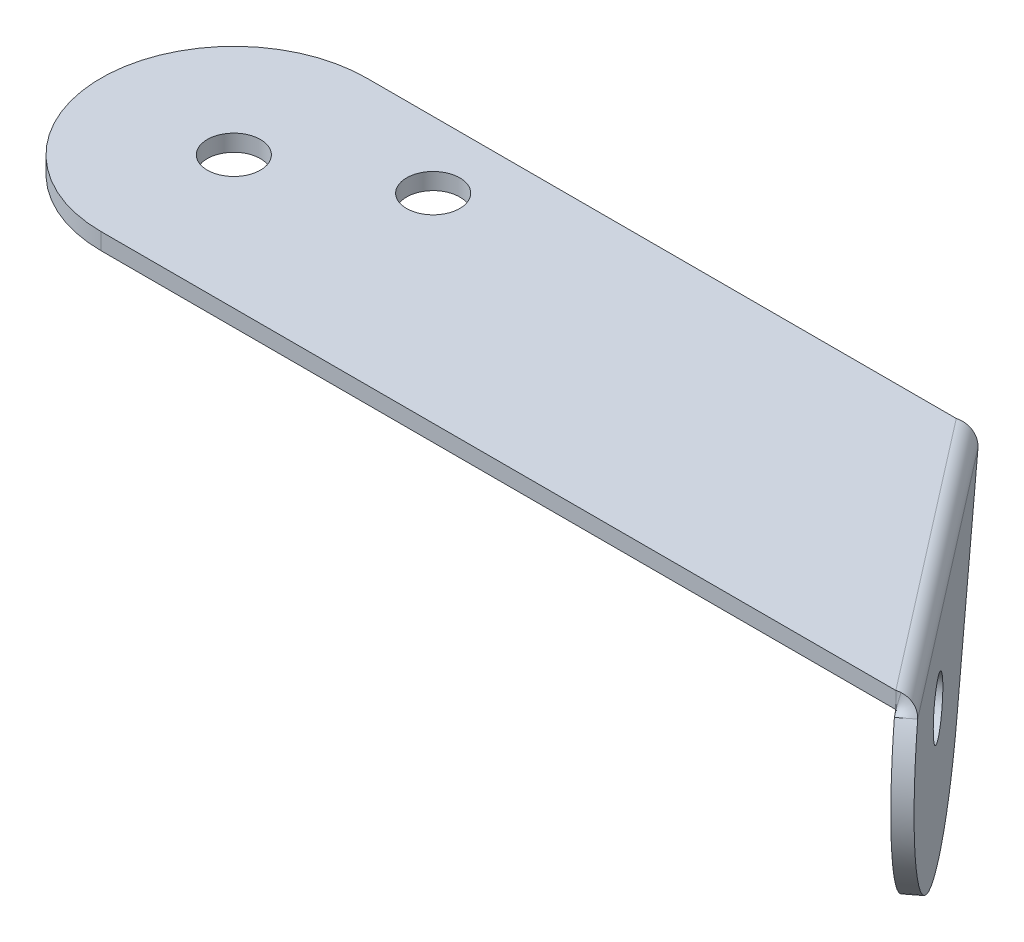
ISO-10303-21;
HEADER;
FILE_DESCRIPTION(('STEP AP214'),'2;1');
FILE_NAME('part.step','',(''),(''),'','','');
FILE_SCHEMA(('AUTOMOTIVE_DESIGN { 1 0 10303 214 1 1 1 1 }'));
ENDSEC;
DATA;
#1=APPLICATION_CONTEXT('core data for automotive mechanical design processes');
#2=APPLICATION_PROTOCOL_DEFINITION('international standard','automotive_design',2000,#1);
#3=PRODUCT_CONTEXT('',#1,'mechanical');
#4=PRODUCT('Part','Part','',(#3));
#5=PRODUCT_RELATED_PRODUCT_CATEGORY('part','',(#4));
#6=PRODUCT_DEFINITION_FORMATION('','',#4);
#7=PRODUCT_DEFINITION_CONTEXT('part definition',#1,'design');
#8=PRODUCT_DEFINITION('design','',#6,#7);
#9=PRODUCT_DEFINITION_SHAPE('','',#8);
#10=(LENGTH_UNIT() NAMED_UNIT(*) SI_UNIT(.MILLI.,.METRE.));
#11=(NAMED_UNIT(*) PLANE_ANGLE_UNIT() SI_UNIT($,.RADIAN.));
#12=(NAMED_UNIT(*) SI_UNIT($,.STERADIAN.) SOLID_ANGLE_UNIT());
#13=UNCERTAINTY_MEASURE_WITH_UNIT(LENGTH_MEASURE(1.E-05),#10,'distance_accuracy_value','');
#14=(GEOMETRIC_REPRESENTATION_CONTEXT(3) GLOBAL_UNCERTAINTY_ASSIGNED_CONTEXT((#13)) GLOBAL_UNIT_ASSIGNED_CONTEXT((#10,
#11,#12)) REPRESENTATION_CONTEXT('',''));
#15=CARTESIAN_POINT('',(0.,0.,0.));
#16=DIRECTION('',(0.,0.,1.));
#17=DIRECTION('',(1.,0.,0.));
#18=AXIS2_PLACEMENT_3D('',#15,#16,#17);
#19=CARTESIAN_POINT('',(44.8366612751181,-4.21600360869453,2.44339402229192));
#20=DIRECTION('',(0.791406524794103,0.,-0.611290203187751));
#21=DIRECTION('',(0.4837790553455,0.611290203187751,0.626324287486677));
#22=AXIS2_PLACEMENT_3D('',#19,#20,#21);
#23=PLANE('',#22);
#24=CARTESIAN_POINT('',(44.8366612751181,-4.21600360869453,2.44339402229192));
#25=DIRECTION('',(0.791406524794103,0.,-0.611290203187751));
#26=DIRECTION('',(0.4837790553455,0.611290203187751,0.626324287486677));
#27=AXIS2_PLACEMENT_3D('',#24,#25,#26);
#28=CIRCLE('',#27,1.60000000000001);
#29=CARTESIAN_POINT('',(45.6107077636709,-3.23793928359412,3.4455128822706));
#30=VERTEX_POINT('',#29);
#31=EDGE_CURVE('E230',#30,#30,#28,.T.);
#32=ORIENTED_EDGE('',*,*,#31,.F.);
#33=EDGE_LOOP('',(#32));
#34=FACE_BOUND('',#33,.T.);
#35=DIRECTION('',(-0.373675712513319,0.791406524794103,-0.4837790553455));
#36=VECTOR('',#35,1.);
#37=CARTESIAN_POINT('',(40.9664288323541,-9.10632523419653,-2.5672002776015));
#38=LINE('',#37,#36);
#39=CARTESIAN_POINT('',(40.9664288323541,-9.10632523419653,-2.5672002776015));
#40=VERTEX_POINT('',#39);
#41=CARTESIAN_POINT('',(36.6714480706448,-0.00999999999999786,-8.12769479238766));
#42=VERTEX_POINT('',#41);
#43=EDGE_CURVE('E238',#40,#42,#38,.T.);
#44=ORIENTED_EDGE('',*,*,#43,.T.);
#45=DIRECTION('',(0.611290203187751,0.,0.791406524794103));
#46=VECTOR('',#45,1.);
#47=CARTESIAN_POINT('',(44.8366612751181,-0.01000000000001,2.44339402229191));
#48=LINE('',#47,#46);
#49=CARTESIAN_POINT('',(48.9965588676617,-0.01000000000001,7.82900314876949));
#50=VERTEX_POINT('',#49);
#51=EDGE_CURVE('E237',#42,#50,#48,.T.);
#52=ORIENTED_EDGE('',*,*,#51,.T.);
#53=CARTESIAN_POINT('',(44.8366612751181,-4.21600360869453,2.44339402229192));
#54=DIRECTION('',(0.791406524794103,0.,-0.611290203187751));
#55=DIRECTION('',(0.4837790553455,0.611290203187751,0.626324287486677));
#56=AXIS2_PLACEMENT_3D('',#53,#54,#55);
#57=CIRCLE('',#56,8.);
#58=EDGE_CURVE('E82',#50,#40,#57,.T.);
#59=ORIENTED_EDGE('',*,*,#58,.T.);
#60=EDGE_LOOP('',(#44,#52,#59));
#61=FACE_BOUND('',#60,.T.);
#62=ADVANCED_FACE('F56',(#34,#61),#23,.T.);
#63=CARTESIAN_POINT('',(44.045254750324,-4.21600360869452,3.05468422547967));
#64=DIRECTION('',(0.791406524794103,0.,-0.611290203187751));
#65=DIRECTION('',(0.4837790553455,0.611290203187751,0.626324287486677));
#66=AXIS2_PLACEMENT_3D('',#63,#64,#65);
#67=PLANE('',#66);
#68=DIRECTION('',(0.611290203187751,0.,0.791406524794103));
#69=VECTOR('',#68,1.);
#70=CARTESIAN_POINT('',(44.045254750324,-0.0100000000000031,3.05468422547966));
#71=LINE('',#70,#69);
#72=CARTESIAN_POINT('',(35.8800415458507,-0.01,-7.51640458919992));
#73=VERTEX_POINT('',#72);
#74=CARTESIAN_POINT('',(48.2051523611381,-0.0100000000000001,8.44029333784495));
#75=VERTEX_POINT('',#74);
#76=EDGE_CURVE('E67',#73,#75,#71,.T.);
#77=ORIENTED_EDGE('',*,*,#76,.F.);
#78=DIRECTION('',(-0.373675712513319,0.791406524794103,-0.4837790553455));
#79=VECTOR('',#78,1.);
#80=CARTESIAN_POINT('',(40.17502230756,-9.10632523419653,-1.95591007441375));
#81=LINE('',#80,#79);
#82=CARTESIAN_POINT('',(40.17502230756,-9.10632523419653,-1.95591007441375));
#83=VERTEX_POINT('',#82);
#84=EDGE_CURVE('E244',#83,#73,#81,.T.);
#85=ORIENTED_EDGE('',*,*,#84,.F.);
#86=CARTESIAN_POINT('',(44.045254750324,-4.21600360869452,3.05468422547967));
#87=DIRECTION('',(0.791406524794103,0.,-0.611290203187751));
#88=DIRECTION('',(0.4837790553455,0.611290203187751,0.626324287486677));
#89=AXIS2_PLACEMENT_3D('',#86,#87,#88);
#90=CIRCLE('',#89,8.);
#91=EDGE_CURVE('E233',#75,#83,#90,.T.);
#92=ORIENTED_EDGE('',*,*,#91,.F.);
#93=EDGE_LOOP('',(#77,#85,#92));
#94=FACE_BOUND('',#93,.T.);
#95=CARTESIAN_POINT('',(44.045254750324,-4.21600360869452,3.05468422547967));
#96=DIRECTION('',(0.791406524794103,0.,-0.611290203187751));
#97=DIRECTION('',(0.4837790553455,0.611290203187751,0.626324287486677));
#98=AXIS2_PLACEMENT_3D('',#95,#96,#97);
#99=CIRCLE('',#98,1.60000000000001);
#100=CARTESIAN_POINT('',(44.8193012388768,-3.23793928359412,4.05680308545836));
#101=VERTEX_POINT('',#100);
#102=EDGE_CURVE('E227',#101,#101,#99,.T.);
#103=ORIENTED_EDGE('',*,*,#102,.T.);
#104=EDGE_LOOP('',(#103));
#105=FACE_BOUND('',#104,.T.);
#106=ADVANCED_FACE('F267',(#94,#105),#67,.F.);
#107=CARTESIAN_POINT('',(44.8366612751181,-4.21600360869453,2.44339402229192));
#108=DIRECTION('',(-0.791406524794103,0.,0.611290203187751));
#109=DIRECTION('',(-0.4837790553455,-0.611290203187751,-0.626324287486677));
#110=AXIS2_PLACEMENT_3D('',#107,#108,#109);
#111=CYLINDRICAL_SURFACE('',#110,8.);
#112=CARTESIAN_POINT('',(48.2051523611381,-0.0100000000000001,8.44029333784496));
#113=CARTESIAN_POINT('',(48.9965588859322,-0.0100000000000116,7.82900313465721));
#114=B_SPLINE_CURVE_WITH_KNOTS('',1,(#112,#113),.UNSPECIFIED.,.F.,.F.,(2,2),(0.,1.),.UNSPECIFIED.);
#115=EDGE_CURVE('E12',#75,#50,#114,.T.);
#116=ORIENTED_EDGE('',*,*,#115,.F.);
#117=ORIENTED_EDGE('',*,*,#91,.T.);
#118=DIRECTION('',(-0.791406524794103,0.,0.611290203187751));
#119=VECTOR('',#118,1.);
#120=CARTESIAN_POINT('',(40.9664288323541,-9.10632523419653,-2.5672002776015));
#121=LINE('',#120,#119);
#122=EDGE_CURVE('E234',#40,#83,#121,.T.);
#123=ORIENTED_EDGE('',*,*,#122,.F.);
#124=ORIENTED_EDGE('',*,*,#58,.F.);
#125=EDGE_LOOP('',(#116,#117,#123,#124));
#126=FACE_BOUND('',#125,.T.);
#127=ADVANCED_FACE('F58',(#126),#111,.T.);
#128=CARTESIAN_POINT('',(40.9664288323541,-9.10632523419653,-2.5672002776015));
#129=DIRECTION('',(0.4837790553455,0.611290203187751,0.626324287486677));
#130=DIRECTION('',(0.373675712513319,-0.791406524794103,0.4837790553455));
#131=AXIS2_PLACEMENT_3D('',#128,#129,#130);
#132=PLANE('',#131);
#133=CARTESIAN_POINT('',(36.6714480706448,-0.00999999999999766,-8.12769479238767));
#134=CARTESIAN_POINT('',(35.8800415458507,-0.01,-7.51640458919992));
#135=B_SPLINE_CURVE_WITH_KNOTS('',1,(#133,#134),.UNSPECIFIED.,.F.,.F.,(2,2),(0.,1.),.UNSPECIFIED.);
#136=EDGE_CURVE('E240',#42,#73,#135,.T.);
#137=ORIENTED_EDGE('',*,*,#136,.F.);
#138=ORIENTED_EDGE('',*,*,#43,.F.);
#139=ORIENTED_EDGE('',*,*,#122,.T.);
#140=ORIENTED_EDGE('',*,*,#84,.T.);
#141=EDGE_LOOP('',(#137,#138,#139,#140));
#142=FACE_BOUND('',#141,.T.);
#143=ADVANCED_FACE('F259',(#142),#132,.F.);
#144=CARTESIAN_POINT('',(44.8366612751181,-4.21600360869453,2.44339402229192));
#145=DIRECTION('',(-0.791406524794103,0.,0.611290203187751));
#146=DIRECTION('',(-0.4837790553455,-0.611290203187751,-0.626324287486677));
#147=AXIS2_PLACEMENT_3D('',#144,#145,#146);
#148=CYLINDRICAL_SURFACE('',#147,1.60000000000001);
#149=ORIENTED_EDGE('',*,*,#31,.T.);
#150=EDGE_LOOP('',(#149));
#151=FACE_BOUND('',#150,.T.);
#152=ORIENTED_EDGE('',*,*,#102,.F.);
#153=EDGE_LOOP('',(#152));
#154=FACE_BOUND('',#153,.T.);
#155=ADVANCED_FACE('F213',(#151,#154),#148,.F.);
#156=CARTESIAN_POINT('',(0.,1.,0.));
#157=DIRECTION('',(0.,-1.,0.));
#158=DIRECTION('',(0.,0.,-1.));
#159=AXIS2_PLACEMENT_3D('',#156,#157,#158);
#160=CYLINDRICAL_SURFACE('',#159,1.6);
#161=CARTESIAN_POINT('',(0.,1.,0.));
#162=DIRECTION('',(0.,1.,0.));
#163=DIRECTION('',(0.,0.,1.));
#164=AXIS2_PLACEMENT_3D('',#161,#162,#163);
#165=CIRCLE('',#164,1.6);
#166=CARTESIAN_POINT('',(0.,1.,1.6));
#167=VERTEX_POINT('',#166);
#168=EDGE_CURVE('E177',#167,#167,#165,.T.);
#169=ORIENTED_EDGE('',*,*,#168,.T.);
#170=EDGE_LOOP('',(#169));
#171=FACE_BOUND('',#170,.T.);
#172=CARTESIAN_POINT('',(0.,0.,0.));
#173=DIRECTION('',(0.,1.,0.));
#174=DIRECTION('',(0.,0.,1.));
#175=AXIS2_PLACEMENT_3D('',#172,#173,#174);
#176=CIRCLE('',#175,1.6);
#177=CARTESIAN_POINT('',(0.,0.,1.6));
#178=VERTEX_POINT('',#177);
#179=EDGE_CURVE('E173',#178,#178,#176,.T.);
#180=ORIENTED_EDGE('',*,*,#179,.F.);
#181=EDGE_LOOP('',(#180));
#182=FACE_BOUND('',#181,.T.);
#183=ADVANCED_FACE('F283',(#171,#182),#160,.F.);
#184=CARTESIAN_POINT('',(8.,1.,-3.99999999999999));
#185=DIRECTION('',(0.,-1.,0.));
#186=DIRECTION('',(0.,0.,-1.));
#187=AXIS2_PLACEMENT_3D('',#184,#185,#186);
#188=CYLINDRICAL_SURFACE('',#187,1.6);
#189=CARTESIAN_POINT('',(8.,1.,-3.99999999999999));
#190=DIRECTION('',(0.,1.,0.));
#191=DIRECTION('',(0.,0.,1.));
#192=AXIS2_PLACEMENT_3D('',#189,#190,#191);
#193=CIRCLE('',#192,1.6);
#194=CARTESIAN_POINT('',(8.,1.,-2.39999999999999));
#195=VERTEX_POINT('',#194);
#196=EDGE_CURVE('E448',#195,#195,#193,.T.);
#197=ORIENTED_EDGE('',*,*,#196,.T.);
#198=EDGE_LOOP('',(#197));
#199=FACE_BOUND('',#198,.T.);
#200=CARTESIAN_POINT('',(8.,0.,-3.99999999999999));
#201=DIRECTION('',(0.,1.,0.));
#202=DIRECTION('',(0.,0.,1.));
#203=AXIS2_PLACEMENT_3D('',#200,#201,#202);
#204=CIRCLE('',#203,1.6);
#205=CARTESIAN_POINT('',(8.,0.,-2.39999999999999));
#206=VERTEX_POINT('',#205);
#207=EDGE_CURVE('E170',#206,#206,#204,.T.);
#208=ORIENTED_EDGE('',*,*,#207,.F.);
#209=EDGE_LOOP('',(#208));
#210=FACE_BOUND('',#209,.T.);
#211=ADVANCED_FACE('F288',(#199,#210),#188,.F.);
#212=CARTESIAN_POINT('',(0.,1.,0.));
#213=DIRECTION('',(0.,-1.,0.));
#214=DIRECTION('',(0.,0.,-1.));
#215=AXIS2_PLACEMENT_3D('',#212,#213,#214);
#216=CYLINDRICAL_SURFACE('',#215,8.);
#217=CARTESIAN_POINT('',(0.,0.,0.));
#218=DIRECTION('',(0.,1.,0.));
#219=DIRECTION('',(0.,0.,1.));
#220=AXIS2_PLACEMENT_3D('',#217,#218,#219);
#221=CIRCLE('',#220,8.);
#222=CARTESIAN_POINT('',(0.,0.,-8.));
#223=VERTEX_POINT('',#222);
#224=CARTESIAN_POINT('',(0.,0.,8.));
#225=VERTEX_POINT('',#224);
#226=EDGE_CURVE('E440',#223,#225,#221,.T.);
#227=ORIENTED_EDGE('',*,*,#226,.T.);
#228=DIRECTION('',(0.,-1.,0.));
#229=VECTOR('',#228,1.);
#230=CARTESIAN_POINT('',(0.,1.,8.));
#231=LINE('',#230,#229);
#232=CARTESIAN_POINT('',(0.,1.,8.));
#233=VERTEX_POINT('',#232);
#234=EDGE_CURVE('E142',#233,#225,#231,.T.);
#235=ORIENTED_EDGE('',*,*,#234,.F.);
#236=CARTESIAN_POINT('',(0.,1.,0.));
#237=DIRECTION('',(0.,1.,0.));
#238=DIRECTION('',(0.,0.,1.));
#239=AXIS2_PLACEMENT_3D('',#236,#237,#238);
#240=CIRCLE('',#239,8.);
#241=CARTESIAN_POINT('',(0.,1.,-8.));
#242=VERTEX_POINT('',#241);
#243=EDGE_CURVE('E437',#242,#233,#240,.T.);
#244=ORIENTED_EDGE('',*,*,#243,.F.);
#245=DIRECTION('',(0.,-1.,0.));
#246=VECTOR('',#245,1.);
#247=CARTESIAN_POINT('',(0.,1.,-8.));
#248=LINE('',#247,#246);
#249=EDGE_CURVE('E435',#242,#223,#248,.T.);
#250=ORIENTED_EDGE('',*,*,#249,.T.);
#251=EDGE_LOOP('',(#227,#235,#244,#250));
#252=FACE_BOUND('',#251,.T.);
#253=ADVANCED_FACE('F459',(#252),#216,.T.);
#254=CARTESIAN_POINT('',(48.,1.,0.));
#255=DIRECTION('',(0.,1.,0.));
#256=DIRECTION('',(0.,0.,1.));
#257=AXIS2_PLACEMENT_3D('',#254,#255,#256);
#258=PLANE('',#257);
#259=DIRECTION('',(0.611290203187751,0.,0.791406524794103));
#260=VECTOR('',#259,1.);
#261=CARTESIAN_POINT('',(44.0373406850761,1.,3.06079712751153));
#262=LINE('',#261,#260);
#263=CARTESIAN_POINT('',(35.4938719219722,1.00000002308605,-8.));
#264=VERTEX_POINT('',#263);
#265=CARTESIAN_POINT('',(47.8524296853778,1.00000002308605,8.00000000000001));
#266=VERTEX_POINT('',#265);
#267=EDGE_CURVE('E192',#264,#266,#262,.T.);
#268=ORIENTED_EDGE('',*,*,#267,.F.);
#269=DIRECTION('',(-1.,0.,0.));
#270=VECTOR('',#269,1.);
#271=CARTESIAN_POINT('',(48.,1.,-8.));
#272=LINE('',#271,#270);
#273=EDGE_CURVE('E432',#264,#242,#272,.T.);
#274=ORIENTED_EDGE('',*,*,#273,.T.);
#275=ORIENTED_EDGE('',*,*,#243,.T.);
#276=DIRECTION('',(1.,0.,0.));
#277=VECTOR('',#276,1.);
#278=CARTESIAN_POINT('',(0.,1.,8.));
#279=LINE('',#278,#277);
#280=EDGE_CURVE('E427',#233,#266,#279,.T.);
#281=ORIENTED_EDGE('',*,*,#280,.T.);
#282=EDGE_LOOP('',(#268,#274,#275,#281));
#283=FACE_BOUND('',#282,.T.);
#284=ORIENTED_EDGE('',*,*,#196,.F.);
#285=EDGE_LOOP('',(#284));
#286=FACE_BOUND('',#285,.T.);
#287=ORIENTED_EDGE('',*,*,#168,.F.);
#288=EDGE_LOOP('',(#287));
#289=FACE_BOUND('',#288,.T.);
#290=ADVANCED_FACE('F204',(#283,#286,#289),#258,.T.);
#291=CARTESIAN_POINT('',(48.,1.,-8.));
#292=DIRECTION('',(0.,0.,1.));
#293=DIRECTION('',(1.,0.,0.));
#294=AXIS2_PLACEMENT_3D('',#291,#292,#293);
#295=PLANE('',#294);
#296=ORIENTED_EDGE('',*,*,#273,.F.);
#297=CARTESIAN_POINT('',(35.4938719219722,2.30860530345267E-08,-8.));
#298=CARTESIAN_POINT('',(35.4938719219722,1.00000002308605,-8.));
#299=B_SPLINE_CURVE_WITH_KNOTS('',1,(#297,#298),.UNSPECIFIED.,.F.,.F.,(2,2),(0.,1.),.UNSPECIFIED.);
#300=CARTESIAN_POINT('',(35.4938719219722,0.,-8.));
#301=VERTEX_POINT('',#300);
#302=EDGE_CURVE('E182',#264,#301,#299,.F.);
#303=ORIENTED_EDGE('',*,*,#302,.T.);
#304=DIRECTION('',(-1.,0.,0.));
#305=VECTOR('',#304,1.);
#306=CARTESIAN_POINT('',(48.,0.,-8.));
#307=LINE('',#306,#305);
#308=EDGE_CURVE('E168',#301,#223,#307,.T.);
#309=ORIENTED_EDGE('',*,*,#308,.T.);
#310=ORIENTED_EDGE('',*,*,#249,.F.);
#311=EDGE_LOOP('',(#296,#303,#309,#310));
#312=FACE_BOUND('',#311,.T.);
#313=ADVANCED_FACE('F194',(#312),#295,.F.);
#314=CARTESIAN_POINT('',(48.,0.,0.));
#315=DIRECTION('',(0.,1.,0.));
#316=DIRECTION('',(0.,0.,1.));
#317=AXIS2_PLACEMENT_3D('',#314,#315,#316);
#318=PLANE('',#317);
#319=ORIENTED_EDGE('',*,*,#179,.T.);
#320=EDGE_LOOP('',(#319));
#321=FACE_BOUND('',#320,.T.);
#322=ORIENTED_EDGE('',*,*,#207,.T.);
#323=EDGE_LOOP('',(#322));
#324=FACE_BOUND('',#323,.T.);
#325=ORIENTED_EDGE('',*,*,#308,.F.);
#326=DIRECTION('',(0.611290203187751,0.,0.791406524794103));
#327=VECTOR('',#326,1.);
#328=CARTESIAN_POINT('',(44.0373406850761,0.,3.06079712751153));
#329=LINE('',#328,#327);
#330=CARTESIAN_POINT('',(47.8524296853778,2.30860530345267E-08,8.));
#331=VERTEX_POINT('',#330);
#332=EDGE_CURVE('E152',#301,#331,#329,.T.);
#333=ORIENTED_EDGE('',*,*,#332,.T.);
#334=DIRECTION('',(1.,0.,0.));
#335=VECTOR('',#334,1.);
#336=CARTESIAN_POINT('',(0.,0.,8.));
#337=LINE('',#336,#335);
#338=EDGE_CURVE('E143',#225,#331,#337,.T.);
#339=ORIENTED_EDGE('',*,*,#338,.F.);
#340=ORIENTED_EDGE('',*,*,#226,.F.);
#341=EDGE_LOOP('',(#325,#333,#339,#340));
#342=FACE_BOUND('',#341,.T.);
#343=ADVANCED_FACE('F167',(#321,#324,#342),#318,.F.);
#344=CARTESIAN_POINT('',(0.,1.,8.));
#345=DIRECTION('',(0.,0.,-1.));
#346=DIRECTION('',(-1.,0.,0.));
#347=AXIS2_PLACEMENT_3D('',#344,#345,#346);
#348=PLANE('',#347);
#349=ORIENTED_EDGE('',*,*,#338,.T.);
#350=CARTESIAN_POINT('',(47.8524296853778,1.00000002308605,8.));
#351=CARTESIAN_POINT('',(47.8524296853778,2.30860530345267E-08,8.));
#352=B_SPLINE_CURVE_WITH_KNOTS('',1,(#350,#351),.UNSPECIFIED.,.F.,.F.,(2,2),(0.,1.),.UNSPECIFIED.);
#353=EDGE_CURVE('E128',#331,#266,#352,.F.);
#354=ORIENTED_EDGE('',*,*,#353,.T.);
#355=ORIENTED_EDGE('',*,*,#280,.F.);
#356=ORIENTED_EDGE('',*,*,#234,.T.);
#357=EDGE_LOOP('',(#349,#354,#355,#356));
#358=FACE_BOUND('',#357,.T.);
#359=ADVANCED_FACE('F162',(#358),#348,.F.);
#360=CARTESIAN_POINT('',(36.6714480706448,-0.00999999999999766,-8.12769479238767));
#361=CARTESIAN_POINT('',(36.6399218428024,0.12222938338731,-8.16851020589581));
#362=CARTESIAN_POINT('',(36.5876013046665,0.2543653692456,-8.19324349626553));
#363=CARTESIAN_POINT('',(36.4444777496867,0.498655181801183,-8.21300622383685));
#364=CARTESIAN_POINT('',(36.3537111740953,0.610692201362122,-8.20805361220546));
#365=CARTESIAN_POINT('',(36.142698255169,0.797663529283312,-8.17537792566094));
#366=CARTESIAN_POINT('',(36.02251013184,0.872524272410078,-8.14769982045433));
#367=CARTESIAN_POINT('',(35.7661349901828,0.973712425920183,-8.07998590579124));
#368=CARTESIAN_POINT('',(35.6300453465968,1.00000002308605,-8.04001511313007));
#369=CARTESIAN_POINT('',(35.4938719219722,1.00000002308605,-8.));
#370=CARTESIAN_POINT('',(35.8800415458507,-0.01,-7.51640458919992));
#371=CARTESIAN_POINT('',(35.8485202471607,-0.00869099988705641,-7.55721362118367));
#372=CARTESIAN_POINT('',(35.81679297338,-0.00738251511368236,-7.59786354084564));
#373=CARTESIAN_POINT('',(35.7529575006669,-0.00496379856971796,-7.67886916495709));
#374=CARTESIAN_POINT('',(35.7208496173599,-0.00385451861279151,-7.71922510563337));
#375=CARTESIAN_POINT('',(35.6563419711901,-0.00200331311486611,-7.79971153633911));
#376=CARTESIAN_POINT('',(35.6239427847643,-0.00126211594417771,-7.8398424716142));
#377=CARTESIAN_POINT('',(35.5589860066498,-0.000260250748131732,-7.91998198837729));
#378=CARTESIAN_POINT('',(35.5264291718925,2.30860529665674E-08,-7.95999114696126));
#379=CARTESIAN_POINT('',(35.4938719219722,2.30860530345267E-08,-8.));
#380=B_SPLINE_SURFACE_WITH_KNOTS('',1,3,((#360,#361,#362,#363,#364,#365,#366,#367,#368,#369),
(#370,#371,#372,#373,#374,#375,#376,#377,#378,#379)),.UNSPECIFIED.,.F.,.F.,.F.,(2,2),(4,2,2,2,
4),(0.,1.),(0.,0.25,0.5,0.75,1.),.UNSPECIFIED.);
#381=CARTESIAN_POINT('',(35.8800415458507,-0.01,-7.51640458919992));
#382=CARTESIAN_POINT('',(35.8485202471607,-0.00869099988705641,-7.55721362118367));
#383=CARTESIAN_POINT('',(35.81679297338,-0.00738251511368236,-7.59786354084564));
#384=CARTESIAN_POINT('',(35.7529575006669,-0.00496379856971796,-7.67886916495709));
#385=CARTESIAN_POINT('',(35.7208496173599,-0.00385451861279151,-7.71922510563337));
#386=CARTESIAN_POINT('',(35.6563419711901,-0.00200331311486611,-7.79971153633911));
#387=CARTESIAN_POINT('',(35.6239427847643,-0.00126211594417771,-7.8398424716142));
#388=CARTESIAN_POINT('',(35.5589860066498,-0.000260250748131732,-7.91998198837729));
#389=CARTESIAN_POINT('',(35.5264291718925,2.30860529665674E-08,-7.95999114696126));
#390=CARTESIAN_POINT('',(35.4938719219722,2.30860530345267E-08,-8.));
#391=B_SPLINE_CURVE_WITH_KNOTS('',3,(#381,#382,#383,#384,#385,#386,#387,#388,#389,#390),
.UNSPECIFIED.,.F.,.F.,(4,2,2,2,4),(0.,0.25,0.5,0.75,1.),.UNSPECIFIED.);
#392=EDGE_CURVE('E157',#73,#301,#391,.T.);
#393=CARTESIAN_POINT('',(35.4938719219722,1.00000002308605,-8.));
#394=CARTESIAN_POINT('',(35.6300453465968,1.00000002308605,-8.04001511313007));
#395=CARTESIAN_POINT('',(35.7661349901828,0.973712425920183,-8.07998590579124));
#396=CARTESIAN_POINT('',(36.02251013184,0.872524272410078,-8.14769982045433));
#397=CARTESIAN_POINT('',(36.142698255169,0.797663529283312,-8.17537792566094));
#398=CARTESIAN_POINT('',(36.3537111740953,0.610692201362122,-8.20805361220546));
#399=CARTESIAN_POINT('',(36.4444777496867,0.498655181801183,-8.21300622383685));
#400=CARTESIAN_POINT('',(36.5876013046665,0.2543653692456,-8.19324349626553));
#401=CARTESIAN_POINT('',(36.6399218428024,0.12222938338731,-8.16851020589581));
#402=CARTESIAN_POINT('',(36.6714480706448,-0.00999999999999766,-8.12769479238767));
#403=B_SPLINE_CURVE_WITH_KNOTS('',3,(#393,#394,#395,#396,#397,#398,#399,#400,#401,#402),
.UNSPECIFIED.,.F.,.F.,(4,2,2,2,4),(0.,0.25,0.5,0.75,1.),.UNSPECIFIED.);
#404=EDGE_CURVE('E306',#42,#264,#403,.F.);
#405=ORIENTED_EDGE('',*,*,#136,.T.);
#406=ORIENTED_EDGE('',*,*,#392,.T.);
#407=ORIENTED_EDGE('',*,*,#302,.F.);
#408=ORIENTED_EDGE('',*,*,#404,.F.);
#409=EDGE_LOOP('',(#405,#406,#407,#408));
#410=FACE_BOUND('',#409,.T.);
#411=ADVANCED_FACE('F212',(#410),#380,.T.);
#412=CARTESIAN_POINT('',(47.8524296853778,1.00000002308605,8.));
#413=CARTESIAN_POINT('',(47.931830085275,1.00000002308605,7.97666787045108));
#414=CARTESIAN_POINT('',(48.0112115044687,0.991135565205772,7.95334260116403));
#415=CARTESIAN_POINT('',(48.0890190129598,0.973633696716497,7.93124083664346));
#416=CARTESIAN_POINT('',(47.8524296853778,2.30860530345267E-08,8.));
#417=CARTESIAN_POINT('',(47.8714149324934,2.30860531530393E-08,8.02333053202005));
#418=CARTESIAN_POINT('',(47.8904001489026,-8.77558730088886E-05,8.04666108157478));
#419=CARTESIAN_POINT('',(47.9093696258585,-0.000261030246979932,8.07000379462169));
#420=B_SPLINE_SURFACE_WITH_KNOTS('',1,3,((#412,#413,#414,#415),(#416,#417,#418,#419)),
.UNSPECIFIED.,.F.,.F.,.F.,(2,2),(4,4),(0.,1.),(0.,1.),.UNSPECIFIED.);
#421=CARTESIAN_POINT('',(47.8524296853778,2.30860530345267E-08,8.));
#422=CARTESIAN_POINT('',(47.8714149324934,2.30860531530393E-08,8.02333053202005));
#423=CARTESIAN_POINT('',(47.8904001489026,-8.77558730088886E-05,8.04666108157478));
#424=CARTESIAN_POINT('',(47.9093696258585,-0.000261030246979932,8.07000379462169));
#425=B_SPLINE_CURVE_WITH_KNOTS('',3,(#421,#422,#423,#424),.UNSPECIFIED.,.F.,.F.,(4,4),(0.,1.),.UNSPECIFIED.);
#426=CARTESIAN_POINT('',(47.9093696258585,-0.000261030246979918,8.07000379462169));
#427=VERTEX_POINT('',#426);
#428=EDGE_CURVE('E132',#331,#427,#425,.T.);
#429=CARTESIAN_POINT('',(47.9093696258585,-0.000261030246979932,8.07000379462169));
#430=CARTESIAN_POINT('',(48.0890190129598,0.973633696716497,7.93124083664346));
#431=B_SPLINE_CURVE_WITH_KNOTS('',1,(#429,#430),.UNSPECIFIED.,.F.,.F.,(2,2),(0.,1.),.UNSPECIFIED.);
#432=CARTESIAN_POINT('',(48.0890190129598,0.973633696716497,7.93124083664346));
#433=VERTEX_POINT('',#432);
#434=EDGE_CURVE('E385',#427,#433,#431,.T.);
#435=CARTESIAN_POINT('',(48.0890190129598,0.973633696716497,7.93124083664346));
#436=CARTESIAN_POINT('',(48.0112115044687,0.991135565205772,7.95334260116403));
#437=CARTESIAN_POINT('',(47.931830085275,1.00000002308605,7.97666787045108));
#438=CARTESIAN_POINT('',(47.8524296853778,1.00000002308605,8.));
#439=B_SPLINE_CURVE_WITH_KNOTS('',3,(#435,#436,#437,#438),.UNSPECIFIED.,.F.,.F.,(4,4),(0.,1.),.UNSPECIFIED.);
#440=EDGE_CURVE('E135',#266,#433,#439,.F.);
#441=ORIENTED_EDGE('',*,*,#353,.F.);
#442=ORIENTED_EDGE('',*,*,#428,.T.);
#443=ORIENTED_EDGE('',*,*,#434,.T.);
#444=ORIENTED_EDGE('',*,*,#440,.F.);
#445=EDGE_LOOP('',(#441,#442,#443,#444));
#446=FACE_BOUND('',#445,.T.);
#447=ADVANCED_FACE('F131',(#446),#420,.T.);
#448=CARTESIAN_POINT('',(48.0890190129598,0.973633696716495,7.93124083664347));
#449=CARTESIAN_POINT('',(48.2002114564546,0.947995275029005,7.89525522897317));
#450=CARTESIAN_POINT('',(48.3079320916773,0.903748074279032,7.86194272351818));
#451=CARTESIAN_POINT('',(48.5072367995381,0.782919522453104,7.80779030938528));
#452=CARTESIAN_POINT('',(48.5987796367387,0.706365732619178,7.78697797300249));
#453=CARTESIAN_POINT('',(48.7581874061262,0.529450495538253,7.76364234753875));
#454=CARTESIAN_POINT('',(48.8260290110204,0.429126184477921,7.76113707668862));
#455=CARTESIAN_POINT('',(48.9331515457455,0.215845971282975,7.77818708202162));
#456=CARTESIAN_POINT('',(48.9724180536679,0.102944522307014,7.7977492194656));
#457=CARTESIAN_POINT('',(48.9965588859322,-0.0100000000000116,7.82900313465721));
#458=CARTESIAN_POINT('',(47.9093696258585,-0.000261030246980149,8.0700037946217));
#459=CARTESIAN_POINT('',(47.9343702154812,-0.000514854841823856,8.10058935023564));
#460=CARTESIAN_POINT('',(47.9593366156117,-0.000952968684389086,8.13120130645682));
#461=CARTESIAN_POINT('',(48.0091094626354,-0.00214929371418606,8.19254877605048));
#462=CARTESIAN_POINT('',(48.0339155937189,-0.00290725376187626,8.22328452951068));
#463=CARTESIAN_POINT('',(48.0832934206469,-0.00465889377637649,8.28493711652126));
#464=CARTESIAN_POINT('',(48.1078648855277,-0.00565220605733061,8.31585412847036));
#465=CARTESIAN_POINT('',(48.1567250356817,-0.00776389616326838,8.37790657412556));
#466=CARTESIAN_POINT('',(48.1810135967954,-0.0088818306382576,8.40904209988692));
#467=CARTESIAN_POINT('',(48.2051523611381,-0.0100000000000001,8.44029333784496));
#468=B_SPLINE_SURFACE_WITH_KNOTS('',1,3,((#448,#449,#450,#451,#452,#453,#454,#455,#456,#457),
(#458,#459,#460,#461,#462,#463,#464,#465,#466,#467)),.UNSPECIFIED.,.F.,.F.,.F.,(2,2),(4,2,2,2,
4),(0.,1.),(0.,0.25,0.5,0.75,1.),.UNSPECIFIED.);
#469=CARTESIAN_POINT('',(47.9093696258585,-0.000261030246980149,8.0700037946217));
#470=CARTESIAN_POINT('',(47.9343702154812,-0.000514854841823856,8.10058935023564));
#471=CARTESIAN_POINT('',(47.9593366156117,-0.000952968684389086,8.13120130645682));
#472=CARTESIAN_POINT('',(48.0091094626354,-0.00214929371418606,8.19254877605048));
#473=CARTESIAN_POINT('',(48.0339155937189,-0.00290725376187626,8.22328452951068));
#474=CARTESIAN_POINT('',(48.0832934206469,-0.00465889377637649,8.28493711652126));
#475=CARTESIAN_POINT('',(48.1078648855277,-0.00565220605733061,8.31585412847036));
#476=CARTESIAN_POINT('',(48.1567250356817,-0.00776389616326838,8.37790657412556));
#477=CARTESIAN_POINT('',(48.1810135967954,-0.0088818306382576,8.40904209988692));
#478=CARTESIAN_POINT('',(48.2051523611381,-0.0100000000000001,8.44029333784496));
#479=B_SPLINE_CURVE_WITH_KNOTS('',3,(#469,#470,#471,#472,#473,#474,#475,#476,#477,#478),
.UNSPECIFIED.,.F.,.F.,(4,2,2,2,4),(0.,0.25,0.5,0.75,1.),.UNSPECIFIED.);
#480=EDGE_CURVE('E155',#427,#75,#479,.T.);
#481=CARTESIAN_POINT('',(48.9965588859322,-0.0100000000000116,7.82900313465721));
#482=CARTESIAN_POINT('',(48.9724180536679,0.102944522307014,7.7977492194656));
#483=CARTESIAN_POINT('',(48.9331515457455,0.215845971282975,7.77818708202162));
#484=CARTESIAN_POINT('',(48.8260290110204,0.429126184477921,7.76113707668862));
#485=CARTESIAN_POINT('',(48.7581874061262,0.529450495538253,7.76364234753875));
#486=CARTESIAN_POINT('',(48.5987796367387,0.706365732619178,7.78697797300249));
#487=CARTESIAN_POINT('',(48.5072367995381,0.782919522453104,7.80779030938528));
#488=CARTESIAN_POINT('',(48.3079320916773,0.903748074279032,7.86194272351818));
#489=CARTESIAN_POINT('',(48.2002114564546,0.947995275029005,7.89525522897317));
#490=CARTESIAN_POINT('',(48.0890190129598,0.973633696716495,7.93124083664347));
#491=B_SPLINE_CURVE_WITH_KNOTS('',3,(#481,#482,#483,#484,#485,#486,#487,#488,#489,#490),
.UNSPECIFIED.,.F.,.F.,(4,2,2,2,4),(0.,0.25,0.5,0.75,1.),.UNSPECIFIED.);
#492=EDGE_CURVE('E74',#433,#50,#491,.F.);
#493=ORIENTED_EDGE('',*,*,#480,.T.);
#494=ORIENTED_EDGE('',*,*,#115,.T.);
#495=ORIENTED_EDGE('',*,*,#492,.F.);
#496=ORIENTED_EDGE('',*,*,#434,.F.);
#497=EDGE_LOOP('',(#493,#494,#495,#496));
#498=FACE_BOUND('',#497,.T.);
#499=ADVANCED_FACE('F327',(#498),#468,.T.);
#500=CARTESIAN_POINT('',(54.4209386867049,-0.01,16.5039165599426));
#501=DIRECTION('',(-0.611290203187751,0.,-0.791406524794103));
#502=DIRECTION('',(-0.791406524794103,0.,0.611290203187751));
#503=AXIS2_PLACEMENT_3D('',#500,#501,#502);
#504=CYLINDRICAL_SURFACE('',#503,1.01000002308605);
#505=ORIENTED_EDGE('',*,*,#440,.T.);
#506=ORIENTED_EDGE('',*,*,#492,.T.);
#507=ORIENTED_EDGE('',*,*,#51,.F.);
#508=ORIENTED_EDGE('',*,*,#404,.T.);
#509=ORIENTED_EDGE('',*,*,#267,.T.);
#510=EDGE_LOOP('',(#505,#506,#507,#508,#509));
#511=FACE_BOUND('',#510,.T.);
#512=ADVANCED_FACE('F326',(#511),#504,.T.);
#513=CARTESIAN_POINT('',(54.4209386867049,-0.01,16.5039165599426));
#514=DIRECTION('',(-0.611290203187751,0.,-0.791406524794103));
#515=DIRECTION('',(-0.791406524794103,0.,0.611290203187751));
#516=AXIS2_PLACEMENT_3D('',#513,#514,#515);
#517=CYLINDRICAL_SURFACE('',#516,0.0100000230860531);
#518=ORIENTED_EDGE('',*,*,#428,.F.);
#519=ORIENTED_EDGE('',*,*,#332,.F.);
#520=ORIENTED_EDGE('',*,*,#392,.F.);
#521=ORIENTED_EDGE('',*,*,#76,.T.);
#522=ORIENTED_EDGE('',*,*,#480,.F.);
#523=EDGE_LOOP('',(#518,#519,#520,#521,#522));
#524=FACE_BOUND('',#523,.T.);
#525=ADVANCED_FACE('F149',(#524),#517,.F.);
#526=CLOSED_SHELL('',(#62,#106,#127,#143,#155,#183,#211,#253,#290,#313,#343,#359,#411,#447,#499,
#512,#525));
#527=MANIFOLD_SOLID_BREP('B2',#526);
#528=ADVANCED_BREP_SHAPE_REPRESENTATION('',(#18,#527),#14);
#529=SHAPE_DEFINITION_REPRESENTATION(#9,#528);
ENDSEC;
END-ISO-10303-21;
